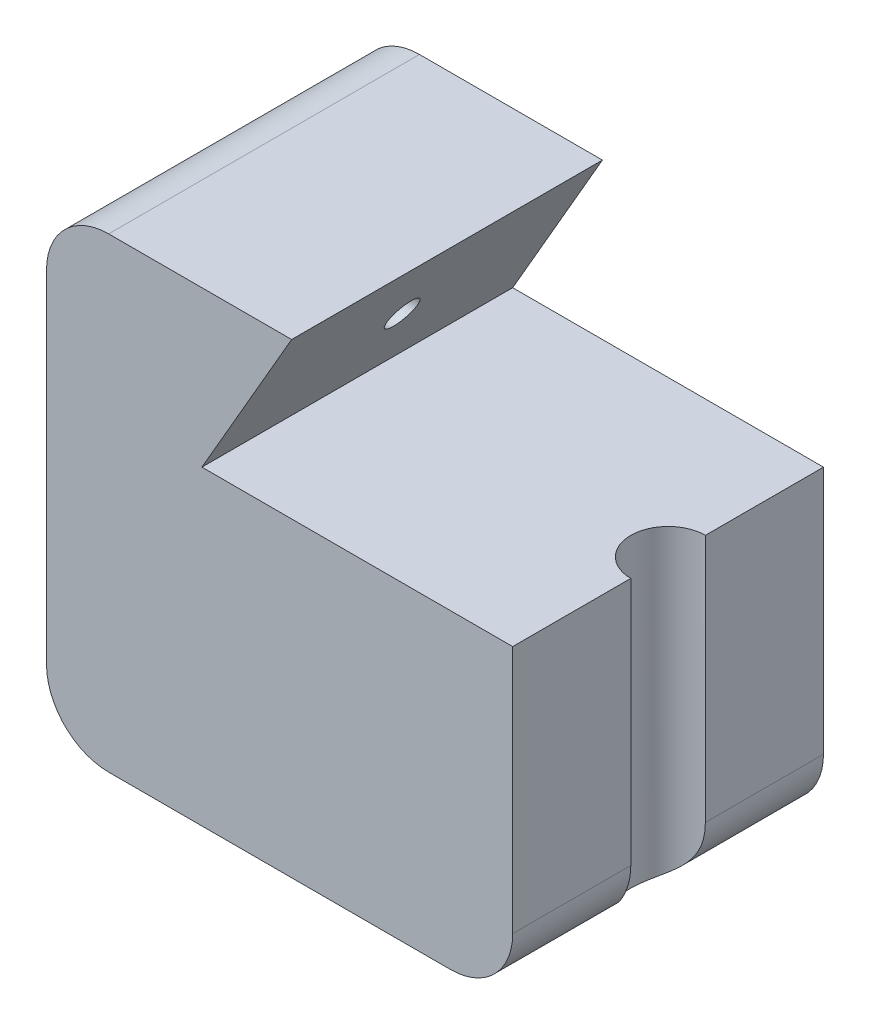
from build123d import *

# Parameters (mm, degrees)
BOSS_EXTRUDE1_DEPTH = 50
SKETCH2_R           = 6
CUT_EXTRUDE1_DEPTH  = 50
CUT_EXTRUDE2_REACH  = 119.26
SKETCH3_R           = 2.5


with BuildPart() as part:
    # Sketch1 → Boss-Extrude1 (new body)
    with BuildSketch(Plane.XY):
        with BuildLine():
            Line((0, 10), (0, 65))
            ThreePointArc((0, 65), (2.928932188, 72.071067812), (10, 75))
            Line((10, 75), (39.43375673, 75))
            Line((39.43375673, 75), (25, 50))
            Line((25, 50), (75, 50))
            Line((75, 50), (75, 10))
            ThreePointArc((75, 10), (72.071067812, 2.928932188), (65, 0))
            Line((65, 0), (10, 0))
            ThreePointArc((10, 0), (2.928932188, 2.928932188), (0, 10))
        make_face()
    extrude(amount=BOSS_EXTRUDE1_DEPTH)

    # Sketch2 → Cut-Extrude1 (cut)
    with BuildSketch(Plane(origin=(0, 50, 0), x_dir=(1, 0, 0), z_dir=(0, 1, 0))):
        with Locations((75, -25)):
            Circle(SKETCH2_R)
    extrude(amount=-CUT_EXTRUDE1_DEPTH, mode=Mode.SUBTRACT)

    # Cut-Extrude2: up to this plane
    cut_extrude2_end = Plane(origin=(39.43375673, 75, 50), z_dir=(-0.8660254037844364, 0.500000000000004, 0))
    # Sketch3 → Cut-Extrude2 (cut, up to the surface)
    with BuildSketch(Plane.ZY, mode=Mode.PRIVATE) as cut_extrude2_sk1:
        with Locations(Location((25, 62.5, 0), (0, 0, 90))):
            Circle(SKETCH3_R)
    cut_extrude2_tool1 = split(extrude(cut_extrude2_sk1.sketch, amount=-CUT_EXTRUDE2_REACH, mode=Mode.PRIVATE), bisect_by=cut_extrude2_end, keep=Keep.BOTH, mode=Mode.PRIVATE)
    add(cut_extrude2_tool1.solids().sort_by_distance((0, 62.5, 25))[0], mode=Mode.SUBTRACT)


solid = part.part
